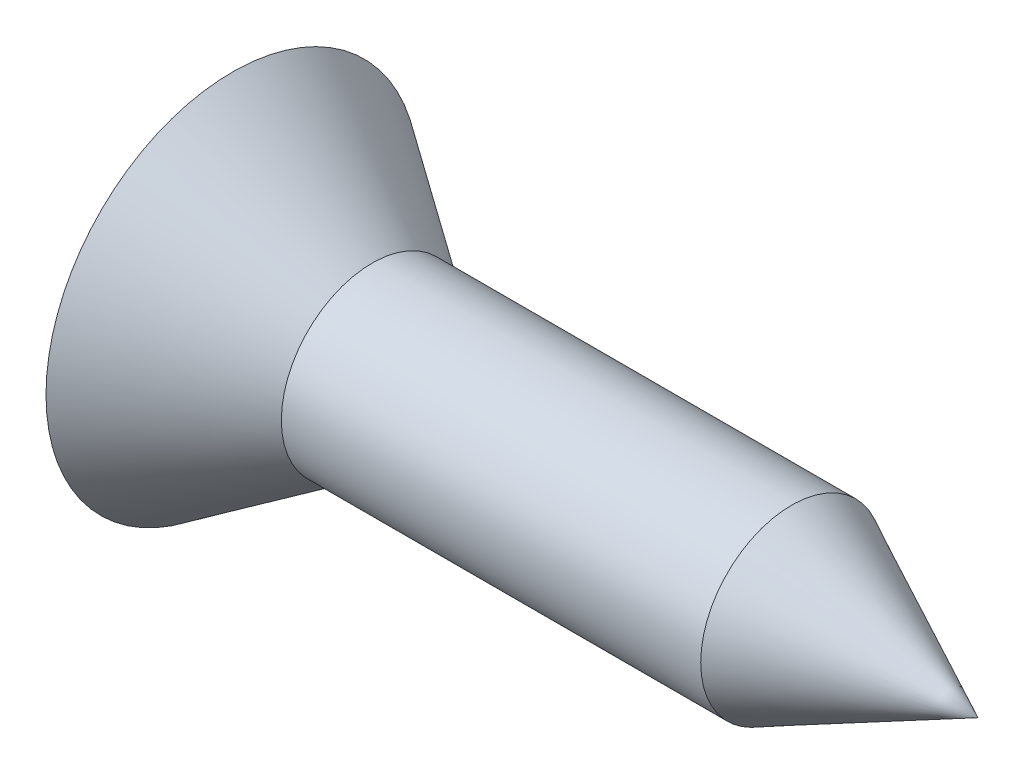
ISO-10303-21;
HEADER;
FILE_DESCRIPTION(('STEP AP214'),'2;1');
FILE_NAME('part.step','',(''),(''),'','','');
FILE_SCHEMA(('AUTOMOTIVE_DESIGN { 1 0 10303 214 1 1 1 1 }'));
ENDSEC;
DATA;
#1=APPLICATION_CONTEXT('core data for automotive mechanical design processes');
#2=APPLICATION_PROTOCOL_DEFINITION('international standard','automotive_design',2000,#1);
#3=PRODUCT_CONTEXT('',#1,'mechanical');
#4=PRODUCT('Part','Part','',(#3));
#5=PRODUCT_RELATED_PRODUCT_CATEGORY('part','',(#4));
#6=PRODUCT_DEFINITION_FORMATION('','',#4);
#7=PRODUCT_DEFINITION_CONTEXT('part definition',#1,'design');
#8=PRODUCT_DEFINITION('design','',#6,#7);
#9=PRODUCT_DEFINITION_SHAPE('','',#8);
#10=(LENGTH_UNIT() NAMED_UNIT(*) SI_UNIT(.MILLI.,.METRE.));
#11=(NAMED_UNIT(*) PLANE_ANGLE_UNIT() SI_UNIT($,.RADIAN.));
#12=(NAMED_UNIT(*) SI_UNIT($,.STERADIAN.) SOLID_ANGLE_UNIT());
#13=UNCERTAINTY_MEASURE_WITH_UNIT(LENGTH_MEASURE(1.E-05),#10,'distance_accuracy_value','');
#14=(GEOMETRIC_REPRESENTATION_CONTEXT(3) GLOBAL_UNCERTAINTY_ASSIGNED_CONTEXT((#13)) GLOBAL_UNIT_ASSIGNED_CONTEXT((#10,
#11,#12)) REPRESENTATION_CONTEXT('',''));
#15=CARTESIAN_POINT('',(0.,0.,0.));
#16=DIRECTION('',(0.,0.,1.));
#17=DIRECTION('',(1.,0.,0.));
#18=AXIS2_PLACEMENT_3D('',#15,#16,#17);
#19=CARTESIAN_POINT('',(16.,0.,0.));
#20=DIRECTION('',(-1.,0.,0.));
#21=DIRECTION('',(0.,0.,1.));
#22=AXIS2_PLACEMENT_3D('',#19,#20,#21);
#23=CONICAL_SURFACE('',#22,0.,0.453597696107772);
#24=CARTESIAN_POINT('',(12.,0.,0.));
#25=DIRECTION('',(-1.,0.,0.));
#26=DIRECTION('',(0.,0.,1.));
#27=AXIS2_PLACEMENT_3D('',#24,#25,#26);
#28=CIRCLE('',#27,1.95);
#29=CARTESIAN_POINT('',(12.,0.,1.94999999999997));
#30=VERTEX_POINT('',#29);
#31=EDGE_CURVE('E11',#30,#30,#28,.T.);
#32=ORIENTED_EDGE('',*,*,#31,.F.);
#33=EDGE_LOOP('',(#32));
#34=FACE_BOUND('',#33,.T.);
#35=CARTESIAN_POINT('',(16.,0.,0.));
#36=VERTEX_POINT('',#35);
#37=VERTEX_LOOP('',#36);
#38=FACE_BOUND('',#37,.T.);
#39=ADVANCED_FACE('F30',(#34,#38),#23,.T.);
#40=CARTESIAN_POINT('',(-40.,0.,0.));
#41=DIRECTION('',(-1.,0.,0.));
#42=DIRECTION('',(0.,0.,1.));
#43=AXIS2_PLACEMENT_3D('',#40,#41,#42);
#44=CYLINDRICAL_SURFACE('',#43,1.95);
#45=CARTESIAN_POINT('',(2.99999999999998,0.,0.));
#46=DIRECTION('',(-1.,0.,0.));
#47=DIRECTION('',(0.,0.,1.));
#48=AXIS2_PLACEMENT_3D('',#45,#46,#47);
#49=CIRCLE('',#48,1.95);
#50=CARTESIAN_POINT('',(2.99999999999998,0.,1.94999999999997));
#51=VERTEX_POINT('',#50);
#52=EDGE_CURVE('E36',#51,#51,#49,.T.);
#53=ORIENTED_EDGE('',*,*,#52,.F.);
#54=EDGE_LOOP('',(#53));
#55=FACE_BOUND('',#54,.T.);
#56=ORIENTED_EDGE('',*,*,#31,.T.);
#57=EDGE_LOOP('',(#56));
#58=FACE_BOUND('',#57,.T.);
#59=ADVANCED_FACE('F40',(#55,#58),#44,.T.);
#60=CARTESIAN_POINT('',(2.99999999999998,0.,0.));
#61=DIRECTION('',(-1.,0.,0.));
#62=DIRECTION('',(0.,0.,1.));
#63=AXIS2_PLACEMENT_3D('',#60,#61,#62);
#64=CONICAL_SURFACE('',#63,1.95,0.599452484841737);
#65=CARTESIAN_POINT('',(0.,0.,0.));
#66=DIRECTION('',(-1.,0.,0.));
#67=DIRECTION('',(0.,0.,1.));
#68=AXIS2_PLACEMENT_3D('',#65,#66,#67);
#69=CIRCLE('',#68,4.);
#70=CARTESIAN_POINT('',(0.,0.,4.));
#71=VERTEX_POINT('',#70);
#72=EDGE_CURVE('E63',#71,#71,#69,.T.);
#73=ORIENTED_EDGE('',*,*,#72,.F.);
#74=EDGE_LOOP('',(#73));
#75=FACE_BOUND('',#74,.T.);
#76=ORIENTED_EDGE('',*,*,#52,.T.);
#77=EDGE_LOOP('',(#76));
#78=FACE_BOUND('',#77,.T.);
#79=ADVANCED_FACE('F45',(#75,#78),#64,.T.);
#80=CARTESIAN_POINT('',(0.,0.,0.));
#81=DIRECTION('',(1.,0.,0.));
#82=DIRECTION('',(0.,0.,-1.));
#83=AXIS2_PLACEMENT_3D('',#80,#81,#82);
#84=PLANE('',#83);
#85=ORIENTED_EDGE('',*,*,#72,.T.);
#86=EDGE_LOOP('',(#85));
#87=FACE_BOUND('',#86,.T.);
#88=ADVANCED_FACE('F52',(#87),#84,.F.);
#89=CLOSED_SHELL('',(#39,#59,#79,#88));
#90=MANIFOLD_SOLID_BREP('B2',#89);
#91=ADVANCED_BREP_SHAPE_REPRESENTATION('',(#18,#90),#14);
#92=SHAPE_DEFINITION_REPRESENTATION(#9,#91);
ENDSEC;
END-ISO-10303-21;
